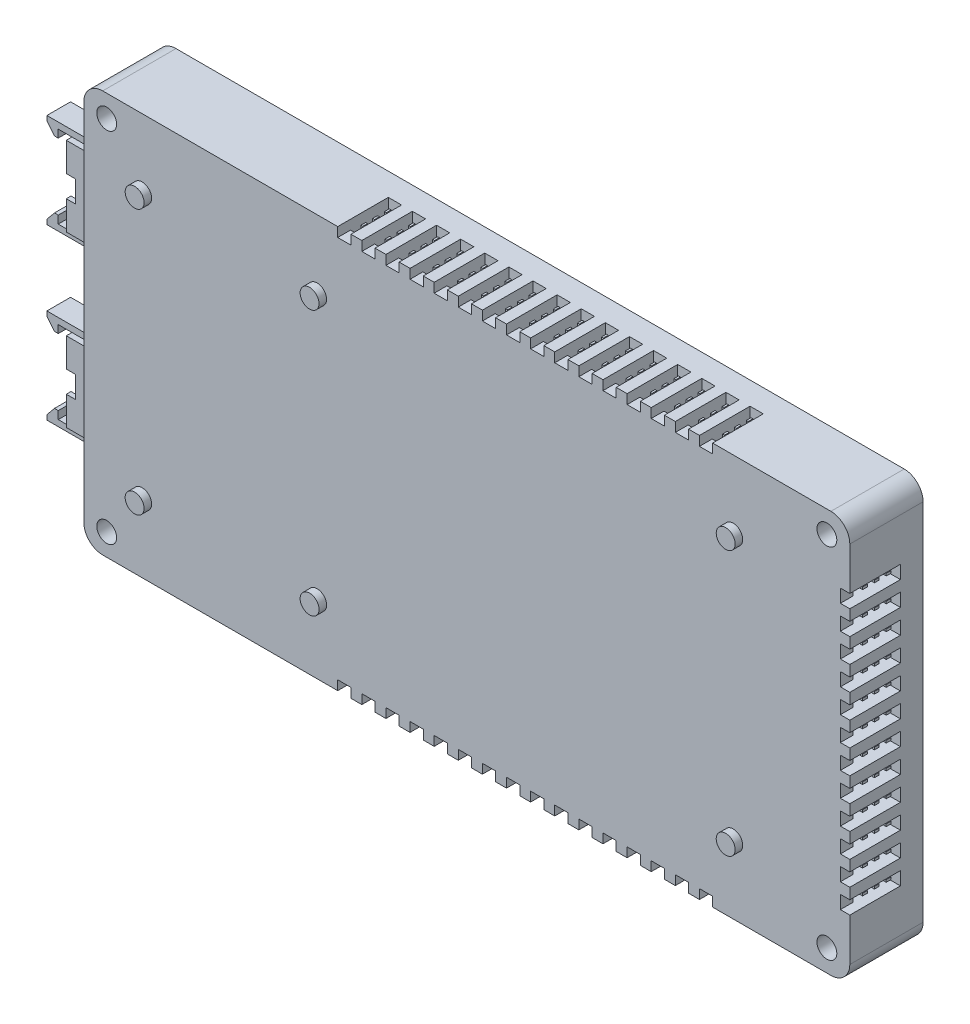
from build123d import *

# Parameters (mm, degrees)
ESQUISSE1_W                = 162
ESQUISSE1_H                = 85
BOSS_EXTRU_1_DEPTH         = 15.5
ESQUISSE3_R                = 2.1
ENL_V_MAT_EXTRU_1_DEPTH    = 93.776613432
CONG_1_R                   = 4
ESQUISSE4_W                = 15
ESQUISSE4_H                = 14.7
ENL_V_MAT_EXTRU_2_DEPTH    = 12.8
BOSS_EXTRU_2_DEPTH         = 7
ESQUISSE6_W                = 2
ESQUISSE6_H                = 4.6
ENL_V_MAT_EXTRU_3_DEPTH    = 1
ESQUISSE7_W                = 0.4
ESQUISSE7_H                = 1.5
ESQUISSE7_W_2              = 1.5
ESQUISSE7_H_2              = 0.4
BOSS_EXTRU_3_DEPTH         = 6
BOSS_EXTRU_4_DEPTH         = 2.5
ESQUISSE10_R               = 2
BOSS_EXTRU_5_DEPTH         = 1.6
ESQUISSE11_W               = 2.8
ESQUISSE11_H               = 2.7
ENL_V_MAT_EXTRU_4_DEPTH    = 2
ESQUISSE12_W               = 2.8
ESQUISSE12_H               = 8
ENL_V_MAT_EXTRU_5_DEPTH    = 7
ESQUISSE13_W               = 0.4
ESQUISSE13_H               = 1
BOSS_EXTRU_6_DEPTH         = 6
R_P_TITION_LIN_AIRE2_COUNT = 16
R_P_TITION_LIN_AIRE2_PITCH = 5.1
SYM_TRIE2_COPY_1_SKETCH_W  = 2.8
SYM_TRIE2_COPY_1_SKETCH_H  = 2.7
SYM_TRIE2_COPY_1_DEPTH     = 2
SYM_TRIE2_COPY_2_SKETCH_W  = 2.8
SYM_TRIE2_COPY_2_SKETCH_H  = 2.7
SYM_TRIE2_COPY_2_DEPTH     = 2
SYM_TRIE2_COPY_3_SKETCH_W  = 2.8
SYM_TRIE2_COPY_3_SKETCH_H  = 2.7
SYM_TRIE2_COPY_3_DEPTH     = 2
SYM_TRIE2_COPY_4_SKETCH_W  = 2.8
SYM_TRIE2_COPY_4_SKETCH_H  = 2.7
SYM_TRIE2_COPY_4_DEPTH     = 2
SYM_TRIE2_COPY_5_SKETCH_W  = 2.8
SYM_TRIE2_COPY_5_SKETCH_H  = 2.7
SYM_TRIE2_COPY_5_DEPTH     = 2
SYM_TRIE2_COPY_6_SKETCH_W  = 2.8
SYM_TRIE2_COPY_6_SKETCH_H  = 2.7
SYM_TRIE2_COPY_6_DEPTH     = 2
SYM_TRIE2_COPY_7_SKETCH_W  = 2.8
SYM_TRIE2_COPY_7_SKETCH_H  = 2.7
SYM_TRIE2_COPY_7_DEPTH     = 2
SYM_TRIE2_COPY_8_SKETCH_W  = 2.8
SYM_TRIE2_COPY_8_SKETCH_H  = 2.7
SYM_TRIE2_COPY_8_DEPTH     = 2
SYM_TRIE2_COPY_9_SKETCH_W  = 2.8
SYM_TRIE2_COPY_9_SKETCH_H  = 2.7
SYM_TRIE2_COPY_9_DEPTH     = 2
SYM_TRIE2_COPY_10_SKETCH_W = 2.8
SYM_TRIE2_COPY_10_SKETCH_H = 2.7
SYM_TRIE2_COPY_10_DEPTH    = 2
SYM_TRIE2_COPY_11_SKETCH_W = 2.8
SYM_TRIE2_COPY_11_SKETCH_H = 2.7
SYM_TRIE2_COPY_11_DEPTH    = 2
SYM_TRIE2_COPY_12_SKETCH_W = 2.8
SYM_TRIE2_COPY_12_SKETCH_H = 2.7
SYM_TRIE2_COPY_12_DEPTH    = 2
SYM_TRIE2_COPY_13_SKETCH_W = 2.8
SYM_TRIE2_COPY_13_SKETCH_H = 2.7
SYM_TRIE2_COPY_13_DEPTH    = 2
SYM_TRIE2_COPY_14_SKETCH_W = 2.8
SYM_TRIE2_COPY_14_SKETCH_H = 2.7
SYM_TRIE2_COPY_14_DEPTH    = 2
SYM_TRIE2_COPY_15_SKETCH_W = 2.8
SYM_TRIE2_COPY_15_SKETCH_H = 2.7
SYM_TRIE2_COPY_15_DEPTH    = 2
SYM_TRIE2_COPY_16_SKETCH_W = 2.8
SYM_TRIE2_COPY_16_SKETCH_H = 8
SYM_TRIE2_COPY_16_DEPTH    = 7
SYM_TRIE2_COPY_17_SKETCH_W = 2.8
SYM_TRIE2_COPY_17_SKETCH_H = 8
SYM_TRIE2_COPY_17_DEPTH    = 7
SYM_TRIE2_COPY_18_SKETCH_W = 2.8
SYM_TRIE2_COPY_18_SKETCH_H = 8
SYM_TRIE2_COPY_18_DEPTH    = 7
SYM_TRIE2_COPY_19_SKETCH_W = 2.8
SYM_TRIE2_COPY_19_SKETCH_H = 8
SYM_TRIE2_COPY_19_DEPTH    = 7
SYM_TRIE2_COPY_20_SKETCH_W = 2.8
SYM_TRIE2_COPY_20_SKETCH_H = 8
SYM_TRIE2_COPY_20_DEPTH    = 7
SYM_TRIE2_COPY_21_SKETCH_W = 2.8
SYM_TRIE2_COPY_21_SKETCH_H = 8
SYM_TRIE2_COPY_21_DEPTH    = 7
SYM_TRIE2_COPY_22_SKETCH_W = 2.8
SYM_TRIE2_COPY_22_SKETCH_H = 8
SYM_TRIE2_COPY_22_DEPTH    = 7
SYM_TRIE2_COPY_23_SKETCH_W = 2.8
SYM_TRIE2_COPY_23_SKETCH_H = 8
SYM_TRIE2_COPY_23_DEPTH    = 7
SYM_TRIE2_COPY_24_SKETCH_W = 2.8
SYM_TRIE2_COPY_24_SKETCH_H = 8
SYM_TRIE2_COPY_24_DEPTH    = 7
SYM_TRIE2_COPY_25_SKETCH_W = 2.8
SYM_TRIE2_COPY_25_SKETCH_H = 8
SYM_TRIE2_COPY_25_DEPTH    = 7
SYM_TRIE2_COPY_26_SKETCH_W = 2.8
SYM_TRIE2_COPY_26_SKETCH_H = 8
SYM_TRIE2_COPY_26_DEPTH    = 7
SYM_TRIE2_COPY_27_SKETCH_W = 2.8
SYM_TRIE2_COPY_27_SKETCH_H = 8
SYM_TRIE2_COPY_27_DEPTH    = 7
SYM_TRIE2_COPY_28_SKETCH_W = 2.8
SYM_TRIE2_COPY_28_SKETCH_H = 8
SYM_TRIE2_COPY_28_DEPTH    = 7
SYM_TRIE2_COPY_29_SKETCH_W = 2.8
SYM_TRIE2_COPY_29_SKETCH_H = 8
SYM_TRIE2_COPY_29_DEPTH    = 7
SYM_TRIE2_COPY_30_SKETCH_W = 2.8
SYM_TRIE2_COPY_30_SKETCH_H = 8
SYM_TRIE2_COPY_30_DEPTH    = 7
SYM_TRIE2_COPY_31_SKETCH_W = 0.4
SYM_TRIE2_COPY_31_SKETCH_H = 1
SYM_TRIE2_COPY_31_DEPTH    = 6
SYM_TRIE2_COPY_32_SKETCH_W = 0.4
SYM_TRIE2_COPY_32_SKETCH_H = 1
SYM_TRIE2_COPY_32_DEPTH    = 6
SYM_TRIE2_COPY_33_SKETCH_W = 0.4
SYM_TRIE2_COPY_33_SKETCH_H = 1
SYM_TRIE2_COPY_33_DEPTH    = 6
SYM_TRIE2_COPY_34_SKETCH_W = 0.4
SYM_TRIE2_COPY_34_SKETCH_H = 1
SYM_TRIE2_COPY_34_DEPTH    = 6
SYM_TRIE2_COPY_35_SKETCH_W = 0.4
SYM_TRIE2_COPY_35_SKETCH_H = 1
SYM_TRIE2_COPY_35_DEPTH    = 6
SYM_TRIE2_COPY_36_SKETCH_W = 0.4
SYM_TRIE2_COPY_36_SKETCH_H = 1
SYM_TRIE2_COPY_36_DEPTH    = 6
SYM_TRIE2_COPY_37_SKETCH_W = 0.4
SYM_TRIE2_COPY_37_SKETCH_H = 1
SYM_TRIE2_COPY_37_DEPTH    = 6
SYM_TRIE2_COPY_38_SKETCH_W = 0.4
SYM_TRIE2_COPY_38_SKETCH_H = 1
SYM_TRIE2_COPY_38_DEPTH    = 6
SYM_TRIE2_COPY_39_SKETCH_W = 0.4
SYM_TRIE2_COPY_39_SKETCH_H = 1
SYM_TRIE2_COPY_39_DEPTH    = 6
SYM_TRIE2_COPY_40_SKETCH_W = 0.4
SYM_TRIE2_COPY_40_SKETCH_H = 1
SYM_TRIE2_COPY_40_DEPTH    = 6
SYM_TRIE2_COPY_41_SKETCH_W = 0.4
SYM_TRIE2_COPY_41_SKETCH_H = 1
SYM_TRIE2_COPY_41_DEPTH    = 6
SYM_TRIE2_COPY_42_SKETCH_W = 0.4
SYM_TRIE2_COPY_42_SKETCH_H = 1
SYM_TRIE2_COPY_42_DEPTH    = 6
SYM_TRIE2_COPY_43_SKETCH_W = 0.4
SYM_TRIE2_COPY_43_SKETCH_H = 1
SYM_TRIE2_COPY_43_DEPTH    = 6
SYM_TRIE2_COPY_44_SKETCH_W = 0.4
SYM_TRIE2_COPY_44_SKETCH_H = 1
SYM_TRIE2_COPY_44_DEPTH    = 6
SYM_TRIE2_COPY_45_SKETCH_W = 0.4
SYM_TRIE2_COPY_45_SKETCH_H = 1
SYM_TRIE2_COPY_45_DEPTH    = 6
ESQUISSE14_W               = 2.7
ESQUISSE14_H               = 2.8
ENL_V_MAT_EXTRU_6_DEPTH    = 2
ESQUISSE15_W               = 8
ESQUISSE15_H               = 2.8
ENL_V_MAT_EXTRU_7_DEPTH    = 7
ESQUISSE16_W               = 1
ESQUISSE16_H               = 0.5
BOSS_EXTRU_7_DEPTH         = 6
R_P_TITION_LIN_AIRE3_COUNT = 12
R_P_TITION_LIN_AIRE3_PITCH = 5.1


with BuildPart() as part:
    # Esquisse1 → Boss.-Extru.1 (new body)
    with BuildSketch(Plane.XY):
        Rectangle(ESQUISSE1_W, ESQUISSE1_H)
    extrude(amount=BOSS_EXTRU_1_DEPTH)

    # Esquisse3 → Enl_v. mat.-Extru.1 (cut, through all)
    with BuildSketch(Plane.XY.offset(15.5)):
        with Locations((-76.15, 37.85)):
            Circle(ESQUISSE3_R)
        with Locations((-76.15, -37.85)):
            Circle(ESQUISSE3_R)
        with Locations((76.15, 37.85)):
            Circle(ESQUISSE3_R)
        with Locations((76.15, -37.85)):
            Circle(ESQUISSE3_R)
    extrude(amount=-ENL_V_MAT_EXTRU_1_DEPTH, mode=Mode.SUBTRACT)

    # Cong_1
    cong_1_edges = [part.edges().sort_by_distance(p)[0] for p in [
        (81, -42.5, 7.75),
        (-81, -42.5, 7.75),
        (-81, 42.5, 7.75),
        (81, 42.5, 7.75),
    ]]
    fillet(cong_1_edges, radius=CONG_1_R)

    # Esquisse4 → Enl_v. mat.-Extru.2 (cut)
    with BuildSketch(Plane(origin=(0, 0, 0), x_dir=(-1, 0, 0), z_dir=(0, 0, -1))):
        with Locations((73.5, 0)):
            Rectangle(ESQUISSE4_W, ESQUISSE4_H)
    extrude(amount=-ENL_V_MAT_EXTRU_2_DEPTH, mode=Mode.SUBTRACT)

    # Esquisse5 → Boss.-Extru.2 (add)
    with BuildSketch(Plane.ZY.offset(81)):
        Polygon((5.4, 26.3), (12.2, 26.3), (12.2, 9.5), (5.4, 9.5), (5.4, 13.9), (6.4, 13.9), (6.4, 10.5), (11.2, 10.5), (11.2, 25.3), (6.4, 25.3), (6.4, 21.9), (5.4, 21.9), align=None)
    boss_extru_2 = extrude(amount=BOSS_EXTRU_2_DEPTH)

    # Esquisse6 → Enl_v. mat.-Extru.3 (cut)
    with BuildSketch(Plane.XY.offset(12.2)):
        with Locations((-87, 17.9)):
            Rectangle(ESQUISSE6_W, ESQUISSE6_H)
    enl_v_mat_extru_3 = extrude(amount=-ENL_V_MAT_EXTRU_3_DEPTH, mode=Mode.SUBTRACT)

    # Esquisse7 → Boss.-Extru.3 (add)
    with BuildSketch(Plane.ZY.offset(81)):
        with Locations((8.8, 23.15)):
            Rectangle(ESQUISSE7_W, ESQUISSE7_H)
        with Locations((8.8, 12.65)):
            Rectangle(ESQUISSE7_W, ESQUISSE7_H)
        with Locations((7.75, 19.8)):
            Rectangle(ESQUISSE7_W_2, ESQUISSE7_H_2)
        with Locations((7.75, 16)):
            Rectangle(ESQUISSE7_W_2, ESQUISSE7_H_2)
        with Locations((9.85, 19.8)):
            Rectangle(ESQUISSE7_W_2, ESQUISSE7_H_2)
        with Locations((9.85, 16)):
            Rectangle(ESQUISSE7_W_2, ESQUISSE7_H_2)
    boss_extru_3 = extrude(amount=BOSS_EXTRU_3_DEPTH)

    # Esquisse9 → Boss.-Extru.4 (add, symmetric)
    with BuildSketch(Plane.XY.offset(8.8)):
        Polygon((-81, 27.9), (-93, 27.9), (-93, 26.9), (-91.4, 24.95), (-90.6, 24.95), (-90.6, 26.6), (-81, 26.6), align=None)
        Polygon((-81, 9.2), (-81, 7.9), (-93, 7.9), (-93, 8.9), (-91.4, 10.85), (-90.6, 10.85), (-90.6, 9.2), align=None)
    boss_extru_4 = extrude(amount=BOSS_EXTRU_4_DEPTH, both=True)

    # Sym_trie1: Boss.-Extru.2, Enl_v. mat.-Extru.3, Boss.-Extru.3, Boss.-Extru.4 across plane
    add(boss_extru_2.mirror(Plane.ZX))
    add(enl_v_mat_extru_3.mirror(Plane.ZX), mode=Mode.SUBTRACT)
    add(boss_extru_3.mirror(Plane.ZX))
    add(boss_extru_4.mirror(Plane.ZX))

    # Esquisse10 → Boss.-Extru.5 (add)
    with BuildSketch(Plane.XY.offset(15.5)):
        with Locations((-68.65, 28)):
            Circle(ESQUISSE10_R)
        with Locations((-68.65, -28)):
            Circle(ESQUISSE10_R)
        with Locations((-31.65, -28)):
            Circle(ESQUISSE10_R)
        with Locations((-31.65, 28)):
            Circle(ESQUISSE10_R)
        with Locations((56.35, 28)):
            Circle(ESQUISSE10_R)
        with Locations((56.35, -28)):
            Circle(ESQUISSE10_R)
    extrude(amount=BOSS_EXTRU_5_DEPTH)

    # Esquisse11 → Enl_v. mat.-Extru.4 (cut)
    with BuildSketch(Plane(origin=(0, 42.5, 0), x_dir=(1, 0, 0), z_dir=(0, 1, 0))):
        with Locations((50.6, -14.15)):
            Rectangle(ESQUISSE11_W, ESQUISSE11_H)
    enl_v_mat_extru_4 = extrude(amount=-ENL_V_MAT_EXTRU_4_DEPTH, mode=Mode.SUBTRACT)

    # Esquisse12 → Enl_v. mat.-Extru.5 (cut)
    with BuildSketch(Plane(origin=(0, 42.5, 0), x_dir=(1, 0, 0), z_dir=(0, 1, 0))):
        with Locations((50.6, -8.8)):
            Rectangle(ESQUISSE12_W, ESQUISSE12_H)
    enl_v_mat_extru_5 = extrude(amount=-ENL_V_MAT_EXTRU_5_DEPTH, mode=Mode.SUBTRACT)

    # Esquisse13 → Boss.-Extru.6 (add)
    with BuildSketch(Plane(origin=(0, 35.5, 0), x_dir=(1, 0, 0), z_dir=(0, 1, 0))):
        with Locations((50.6, -6.3)):
            Rectangle(ESQUISSE13_W, ESQUISSE13_H)
        with Locations((50.6, -8.8)):
            Rectangle(ESQUISSE13_W, ESQUISSE13_H)
        with Locations((50.6, -11.3)):
            Rectangle(ESQUISSE13_W, ESQUISSE13_H)
    boss_extru_6 = extrude(amount=BOSS_EXTRU_6_DEPTH)

    # R_p_tition lin_aire2: Enl_v. mat.-Extru.4, Enl_v. mat.-Extru.5, Boss.-Extru.6 ×16
    with Locations(*[(-i * R_P_TITION_LIN_AIRE2_PITCH, 0, 0) for i in range(1, R_P_TITION_LIN_AIRE2_COUNT)]):
        add(enl_v_mat_extru_4, mode=Mode.SUBTRACT)
        add(enl_v_mat_extru_5, mode=Mode.SUBTRACT)
        add(boss_extru_6)

    # Sym_trie2: Enl_v. mat.-Extru.4, Enl_v. mat.-Extru.5, Boss.-Extru.6 across plane
    add(enl_v_mat_extru_4.mirror(Plane.ZX), mode=Mode.SUBTRACT)
    add(enl_v_mat_extru_5.mirror(Plane.ZX), mode=Mode.SUBTRACT)
    add(boss_extru_6.mirror(Plane.ZX))

    # Sym_trie2 copy 1 sketch → Sym_trie2 copy 1 (cut)
    with BuildSketch(Plane(origin=(-5.1, -42.5, 0), x_dir=(1, 0, 0), z_dir=(0, -1, 0))):
        with Locations((50.6, 14.15)):
            Rectangle(SYM_TRIE2_COPY_1_SKETCH_W, SYM_TRIE2_COPY_1_SKETCH_H)
    extrude(amount=-SYM_TRIE2_COPY_1_DEPTH, mode=Mode.SUBTRACT)

    # Sym_trie2 copy 2 sketch → Sym_trie2 copy 2 (cut)
    with BuildSketch(Plane(origin=(-10.2, -42.5, 0), x_dir=(1, 0, 0), z_dir=(0, -1, 0))):
        with Locations((50.6, 14.15)):
            Rectangle(SYM_TRIE2_COPY_2_SKETCH_W, SYM_TRIE2_COPY_2_SKETCH_H)
    extrude(amount=-SYM_TRIE2_COPY_2_DEPTH, mode=Mode.SUBTRACT)

    # Sym_trie2 copy 3 sketch → Sym_trie2 copy 3 (cut)
    with BuildSketch(Plane(origin=(-15.3, -42.5, 0), x_dir=(1, 0, 0), z_dir=(0, -1, 0))):
        with Locations((50.6, 14.15)):
            Rectangle(SYM_TRIE2_COPY_3_SKETCH_W, SYM_TRIE2_COPY_3_SKETCH_H)
    extrude(amount=-SYM_TRIE2_COPY_3_DEPTH, mode=Mode.SUBTRACT)

    # Sym_trie2 copy 4 sketch → Sym_trie2 copy 4 (cut)
    with BuildSketch(Plane(origin=(-20.4, -42.5, 0), x_dir=(1, 0, 0), z_dir=(0, -1, 0))):
        with Locations((50.6, 14.15)):
            Rectangle(SYM_TRIE2_COPY_4_SKETCH_W, SYM_TRIE2_COPY_4_SKETCH_H)
    extrude(amount=-SYM_TRIE2_COPY_4_DEPTH, mode=Mode.SUBTRACT)

    # Sym_trie2 copy 5 sketch → Sym_trie2 copy 5 (cut)
    with BuildSketch(Plane(origin=(-25.5, -42.5, 0), x_dir=(1, 0, 0), z_dir=(0, -1, 0))):
        with Locations((50.6, 14.15)):
            Rectangle(SYM_TRIE2_COPY_5_SKETCH_W, SYM_TRIE2_COPY_5_SKETCH_H)
    extrude(amount=-SYM_TRIE2_COPY_5_DEPTH, mode=Mode.SUBTRACT)

    # Sym_trie2 copy 6 sketch → Sym_trie2 copy 6 (cut)
    with BuildSketch(Plane(origin=(-30.6, -42.5, 0), x_dir=(1, 0, 0), z_dir=(0, -1, 0))):
        with Locations((50.6, 14.15)):
            Rectangle(SYM_TRIE2_COPY_6_SKETCH_W, SYM_TRIE2_COPY_6_SKETCH_H)
    extrude(amount=-SYM_TRIE2_COPY_6_DEPTH, mode=Mode.SUBTRACT)

    # Sym_trie2 copy 7 sketch → Sym_trie2 copy 7 (cut)
    with BuildSketch(Plane(origin=(-35.7, -42.5, 0), x_dir=(1, 0, 0), z_dir=(0, -1, 0))):
        with Locations((50.6, 14.15)):
            Rectangle(SYM_TRIE2_COPY_7_SKETCH_W, SYM_TRIE2_COPY_7_SKETCH_H)
    extrude(amount=-SYM_TRIE2_COPY_7_DEPTH, mode=Mode.SUBTRACT)

    # Sym_trie2 copy 8 sketch → Sym_trie2 copy 8 (cut)
    with BuildSketch(Plane(origin=(-40.8, -42.5, 0), x_dir=(1, 0, 0), z_dir=(0, -1, 0))):
        with Locations((50.6, 14.15)):
            Rectangle(SYM_TRIE2_COPY_8_SKETCH_W, SYM_TRIE2_COPY_8_SKETCH_H)
    extrude(amount=-SYM_TRIE2_COPY_8_DEPTH, mode=Mode.SUBTRACT)

    # Sym_trie2 copy 9 sketch → Sym_trie2 copy 9 (cut)
    with BuildSketch(Plane(origin=(-45.9, -42.5, 0), x_dir=(1, 0, 0), z_dir=(0, -1, 0))):
        with Locations((50.6, 14.15)):
            Rectangle(SYM_TRIE2_COPY_9_SKETCH_W, SYM_TRIE2_COPY_9_SKETCH_H)
    extrude(amount=-SYM_TRIE2_COPY_9_DEPTH, mode=Mode.SUBTRACT)

    # Sym_trie2 copy 10 sketch → Sym_trie2 copy 10 (cut)
    with BuildSketch(Plane(origin=(-51, -42.5, 0), x_dir=(1, 0, 0), z_dir=(0, -1, 0))):
        with Locations((50.6, 14.15)):
            Rectangle(SYM_TRIE2_COPY_10_SKETCH_W, SYM_TRIE2_COPY_10_SKETCH_H)
    extrude(amount=-SYM_TRIE2_COPY_10_DEPTH, mode=Mode.SUBTRACT)

    # Sym_trie2 copy 11 sketch → Sym_trie2 copy 11 (cut)
    with BuildSketch(Plane(origin=(-56.1, -42.5, 0), x_dir=(1, 0, 0), z_dir=(0, -1, 0))):
        with Locations((50.6, 14.15)):
            Rectangle(SYM_TRIE2_COPY_11_SKETCH_W, SYM_TRIE2_COPY_11_SKETCH_H)
    extrude(amount=-SYM_TRIE2_COPY_11_DEPTH, mode=Mode.SUBTRACT)

    # Sym_trie2 copy 12 sketch → Sym_trie2 copy 12 (cut)
    with BuildSketch(Plane(origin=(-61.2, -42.5, 0), x_dir=(1, 0, 0), z_dir=(0, -1, 0))):
        with Locations((50.6, 14.15)):
            Rectangle(SYM_TRIE2_COPY_12_SKETCH_W, SYM_TRIE2_COPY_12_SKETCH_H)
    extrude(amount=-SYM_TRIE2_COPY_12_DEPTH, mode=Mode.SUBTRACT)

    # Sym_trie2 copy 13 sketch → Sym_trie2 copy 13 (cut)
    with BuildSketch(Plane(origin=(-66.3, -42.5, 0), x_dir=(1, 0, 0), z_dir=(0, -1, 0))):
        with Locations((50.6, 14.15)):
            Rectangle(SYM_TRIE2_COPY_13_SKETCH_W, SYM_TRIE2_COPY_13_SKETCH_H)
    extrude(amount=-SYM_TRIE2_COPY_13_DEPTH, mode=Mode.SUBTRACT)

    # Sym_trie2 copy 14 sketch → Sym_trie2 copy 14 (cut)
    with BuildSketch(Plane(origin=(-71.4, -42.5, 0), x_dir=(1, 0, 0), z_dir=(0, -1, 0))):
        with Locations((50.6, 14.15)):
            Rectangle(SYM_TRIE2_COPY_14_SKETCH_W, SYM_TRIE2_COPY_14_SKETCH_H)
    extrude(amount=-SYM_TRIE2_COPY_14_DEPTH, mode=Mode.SUBTRACT)

    # Sym_trie2 copy 15 sketch → Sym_trie2 copy 15 (cut)
    with BuildSketch(Plane(origin=(-76.5, -42.5, 0), x_dir=(1, 0, 0), z_dir=(0, -1, 0))):
        with Locations((50.6, 14.15)):
            Rectangle(SYM_TRIE2_COPY_15_SKETCH_W, SYM_TRIE2_COPY_15_SKETCH_H)
    extrude(amount=-SYM_TRIE2_COPY_15_DEPTH, mode=Mode.SUBTRACT)

    # Sym_trie2 copy 16 sketch → Sym_trie2 copy 16 (cut)
    with BuildSketch(Plane(origin=(-5.1, -42.5, 0), x_dir=(1, 0, 0), z_dir=(0, -1, 0))):
        with Locations((50.6, 8.8)):
            Rectangle(SYM_TRIE2_COPY_16_SKETCH_W, SYM_TRIE2_COPY_16_SKETCH_H)
    extrude(amount=-SYM_TRIE2_COPY_16_DEPTH, mode=Mode.SUBTRACT)

    # Sym_trie2 copy 17 sketch → Sym_trie2 copy 17 (cut)
    with BuildSketch(Plane(origin=(-10.2, -42.5, 0), x_dir=(1, 0, 0), z_dir=(0, -1, 0))):
        with Locations((50.6, 8.8)):
            Rectangle(SYM_TRIE2_COPY_17_SKETCH_W, SYM_TRIE2_COPY_17_SKETCH_H)
    extrude(amount=-SYM_TRIE2_COPY_17_DEPTH, mode=Mode.SUBTRACT)

    # Sym_trie2 copy 18 sketch → Sym_trie2 copy 18 (cut)
    with BuildSketch(Plane(origin=(-15.3, -42.5, 0), x_dir=(1, 0, 0), z_dir=(0, -1, 0))):
        with Locations((50.6, 8.8)):
            Rectangle(SYM_TRIE2_COPY_18_SKETCH_W, SYM_TRIE2_COPY_18_SKETCH_H)
    extrude(amount=-SYM_TRIE2_COPY_18_DEPTH, mode=Mode.SUBTRACT)

    # Sym_trie2 copy 19 sketch → Sym_trie2 copy 19 (cut)
    with BuildSketch(Plane(origin=(-20.4, -42.5, 0), x_dir=(1, 0, 0), z_dir=(0, -1, 0))):
        with Locations((50.6, 8.8)):
            Rectangle(SYM_TRIE2_COPY_19_SKETCH_W, SYM_TRIE2_COPY_19_SKETCH_H)
    extrude(amount=-SYM_TRIE2_COPY_19_DEPTH, mode=Mode.SUBTRACT)

    # Sym_trie2 copy 20 sketch → Sym_trie2 copy 20 (cut)
    with BuildSketch(Plane(origin=(-25.5, -42.5, 0), x_dir=(1, 0, 0), z_dir=(0, -1, 0))):
        with Locations((50.6, 8.8)):
            Rectangle(SYM_TRIE2_COPY_20_SKETCH_W, SYM_TRIE2_COPY_20_SKETCH_H)
    extrude(amount=-SYM_TRIE2_COPY_20_DEPTH, mode=Mode.SUBTRACT)

    # Sym_trie2 copy 21 sketch → Sym_trie2 copy 21 (cut)
    with BuildSketch(Plane(origin=(-30.6, -42.5, 0), x_dir=(1, 0, 0), z_dir=(0, -1, 0))):
        with Locations((50.6, 8.8)):
            Rectangle(SYM_TRIE2_COPY_21_SKETCH_W, SYM_TRIE2_COPY_21_SKETCH_H)
    extrude(amount=-SYM_TRIE2_COPY_21_DEPTH, mode=Mode.SUBTRACT)

    # Sym_trie2 copy 22 sketch → Sym_trie2 copy 22 (cut)
    with BuildSketch(Plane(origin=(-35.7, -42.5, 0), x_dir=(1, 0, 0), z_dir=(0, -1, 0))):
        with Locations((50.6, 8.8)):
            Rectangle(SYM_TRIE2_COPY_22_SKETCH_W, SYM_TRIE2_COPY_22_SKETCH_H)
    extrude(amount=-SYM_TRIE2_COPY_22_DEPTH, mode=Mode.SUBTRACT)

    # Sym_trie2 copy 23 sketch → Sym_trie2 copy 23 (cut)
    with BuildSketch(Plane(origin=(-40.8, -42.5, 0), x_dir=(1, 0, 0), z_dir=(0, -1, 0))):
        with Locations((50.6, 8.8)):
            Rectangle(SYM_TRIE2_COPY_23_SKETCH_W, SYM_TRIE2_COPY_23_SKETCH_H)
    extrude(amount=-SYM_TRIE2_COPY_23_DEPTH, mode=Mode.SUBTRACT)

    # Sym_trie2 copy 24 sketch → Sym_trie2 copy 24 (cut)
    with BuildSketch(Plane(origin=(-45.9, -42.5, 0), x_dir=(1, 0, 0), z_dir=(0, -1, 0))):
        with Locations((50.6, 8.8)):
            Rectangle(SYM_TRIE2_COPY_24_SKETCH_W, SYM_TRIE2_COPY_24_SKETCH_H)
    extrude(amount=-SYM_TRIE2_COPY_24_DEPTH, mode=Mode.SUBTRACT)

    # Sym_trie2 copy 25 sketch → Sym_trie2 copy 25 (cut)
    with BuildSketch(Plane(origin=(-51, -42.5, 0), x_dir=(1, 0, 0), z_dir=(0, -1, 0))):
        with Locations((50.6, 8.8)):
            Rectangle(SYM_TRIE2_COPY_25_SKETCH_W, SYM_TRIE2_COPY_25_SKETCH_H)
    extrude(amount=-SYM_TRIE2_COPY_25_DEPTH, mode=Mode.SUBTRACT)

    # Sym_trie2 copy 26 sketch → Sym_trie2 copy 26 (cut)
    with BuildSketch(Plane(origin=(-56.1, -42.5, 0), x_dir=(1, 0, 0), z_dir=(0, -1, 0))):
        with Locations((50.6, 8.8)):
            Rectangle(SYM_TRIE2_COPY_26_SKETCH_W, SYM_TRIE2_COPY_26_SKETCH_H)
    extrude(amount=-SYM_TRIE2_COPY_26_DEPTH, mode=Mode.SUBTRACT)

    # Sym_trie2 copy 27 sketch → Sym_trie2 copy 27 (cut)
    with BuildSketch(Plane(origin=(-61.2, -42.5, 0), x_dir=(1, 0, 0), z_dir=(0, -1, 0))):
        with Locations((50.6, 8.8)):
            Rectangle(SYM_TRIE2_COPY_27_SKETCH_W, SYM_TRIE2_COPY_27_SKETCH_H)
    extrude(amount=-SYM_TRIE2_COPY_27_DEPTH, mode=Mode.SUBTRACT)

    # Sym_trie2 copy 28 sketch → Sym_trie2 copy 28 (cut)
    with BuildSketch(Plane(origin=(-66.3, -42.5, 0), x_dir=(1, 0, 0), z_dir=(0, -1, 0))):
        with Locations((50.6, 8.8)):
            Rectangle(SYM_TRIE2_COPY_28_SKETCH_W, SYM_TRIE2_COPY_28_SKETCH_H)
    extrude(amount=-SYM_TRIE2_COPY_28_DEPTH, mode=Mode.SUBTRACT)

    # Sym_trie2 copy 29 sketch → Sym_trie2 copy 29 (cut)
    with BuildSketch(Plane(origin=(-71.4, -42.5, 0), x_dir=(1, 0, 0), z_dir=(0, -1, 0))):
        with Locations((50.6, 8.8)):
            Rectangle(SYM_TRIE2_COPY_29_SKETCH_W, SYM_TRIE2_COPY_29_SKETCH_H)
    extrude(amount=-SYM_TRIE2_COPY_29_DEPTH, mode=Mode.SUBTRACT)

    # Sym_trie2 copy 30 sketch → Sym_trie2 copy 30 (cut)
    with BuildSketch(Plane(origin=(-76.5, -42.5, 0), x_dir=(1, 0, 0), z_dir=(0, -1, 0))):
        with Locations((50.6, 8.8)):
            Rectangle(SYM_TRIE2_COPY_30_SKETCH_W, SYM_TRIE2_COPY_30_SKETCH_H)
    extrude(amount=-SYM_TRIE2_COPY_30_DEPTH, mode=Mode.SUBTRACT)

    # Sym_trie2 copy 31 sketch → Sym_trie2 copy 31 (add)
    with BuildSketch(Plane(origin=(-5.1, -35.5, 0), x_dir=(1, 0, 0), z_dir=(0, -1, 0))):
        with Locations((50.6, 6.3)):
            Rectangle(SYM_TRIE2_COPY_31_SKETCH_W, SYM_TRIE2_COPY_31_SKETCH_H)
        with Locations((50.6, 8.8)):
            Rectangle(SYM_TRIE2_COPY_31_SKETCH_W, SYM_TRIE2_COPY_31_SKETCH_H)
        with Locations((50.6, 11.3)):
            Rectangle(SYM_TRIE2_COPY_31_SKETCH_W, SYM_TRIE2_COPY_31_SKETCH_H)
    extrude(amount=SYM_TRIE2_COPY_31_DEPTH)

    # Sym_trie2 copy 32 sketch → Sym_trie2 copy 32 (add)
    with BuildSketch(Plane(origin=(-10.2, -35.5, 0), x_dir=(1, 0, 0), z_dir=(0, -1, 0))):
        with Locations((50.6, 6.3)):
            Rectangle(SYM_TRIE2_COPY_32_SKETCH_W, SYM_TRIE2_COPY_32_SKETCH_H)
        with Locations((50.6, 8.8)):
            Rectangle(SYM_TRIE2_COPY_32_SKETCH_W, SYM_TRIE2_COPY_32_SKETCH_H)
        with Locations((50.6, 11.3)):
            Rectangle(SYM_TRIE2_COPY_32_SKETCH_W, SYM_TRIE2_COPY_32_SKETCH_H)
    extrude(amount=SYM_TRIE2_COPY_32_DEPTH)

    # Sym_trie2 copy 33 sketch → Sym_trie2 copy 33 (add)
    with BuildSketch(Plane(origin=(-15.3, -35.5, 0), x_dir=(1, 0, 0), z_dir=(0, -1, 0))):
        with Locations((50.6, 6.3)):
            Rectangle(SYM_TRIE2_COPY_33_SKETCH_W, SYM_TRIE2_COPY_33_SKETCH_H)
        with Locations((50.6, 8.8)):
            Rectangle(SYM_TRIE2_COPY_33_SKETCH_W, SYM_TRIE2_COPY_33_SKETCH_H)
        with Locations((50.6, 11.3)):
            Rectangle(SYM_TRIE2_COPY_33_SKETCH_W, SYM_TRIE2_COPY_33_SKETCH_H)
    extrude(amount=SYM_TRIE2_COPY_33_DEPTH)

    # Sym_trie2 copy 34 sketch → Sym_trie2 copy 34 (add)
    with BuildSketch(Plane(origin=(-20.4, -35.5, 0), x_dir=(1, 0, 0), z_dir=(0, -1, 0))):
        with Locations((50.6, 6.3)):
            Rectangle(SYM_TRIE2_COPY_34_SKETCH_W, SYM_TRIE2_COPY_34_SKETCH_H)
        with Locations((50.6, 8.8)):
            Rectangle(SYM_TRIE2_COPY_34_SKETCH_W, SYM_TRIE2_COPY_34_SKETCH_H)
        with Locations((50.6, 11.3)):
            Rectangle(SYM_TRIE2_COPY_34_SKETCH_W, SYM_TRIE2_COPY_34_SKETCH_H)
    extrude(amount=SYM_TRIE2_COPY_34_DEPTH)

    # Sym_trie2 copy 35 sketch → Sym_trie2 copy 35 (add)
    with BuildSketch(Plane(origin=(-25.5, -35.5, 0), x_dir=(1, 0, 0), z_dir=(0, -1, 0))):
        with Locations((50.6, 6.3)):
            Rectangle(SYM_TRIE2_COPY_35_SKETCH_W, SYM_TRIE2_COPY_35_SKETCH_H)
        with Locations((50.6, 8.8)):
            Rectangle(SYM_TRIE2_COPY_35_SKETCH_W, SYM_TRIE2_COPY_35_SKETCH_H)
        with Locations((50.6, 11.3)):
            Rectangle(SYM_TRIE2_COPY_35_SKETCH_W, SYM_TRIE2_COPY_35_SKETCH_H)
    extrude(amount=SYM_TRIE2_COPY_35_DEPTH)

    # Sym_trie2 copy 36 sketch → Sym_trie2 copy 36 (add)
    with BuildSketch(Plane(origin=(-30.6, -35.5, 0), x_dir=(1, 0, 0), z_dir=(0, -1, 0))):
        with Locations((50.6, 6.3)):
            Rectangle(SYM_TRIE2_COPY_36_SKETCH_W, SYM_TRIE2_COPY_36_SKETCH_H)
        with Locations((50.6, 8.8)):
            Rectangle(SYM_TRIE2_COPY_36_SKETCH_W, SYM_TRIE2_COPY_36_SKETCH_H)
        with Locations((50.6, 11.3)):
            Rectangle(SYM_TRIE2_COPY_36_SKETCH_W, SYM_TRIE2_COPY_36_SKETCH_H)
    extrude(amount=SYM_TRIE2_COPY_36_DEPTH)

    # Sym_trie2 copy 37 sketch → Sym_trie2 copy 37 (add)
    with BuildSketch(Plane(origin=(-35.7, -35.5, 0), x_dir=(1, 0, 0), z_dir=(0, -1, 0))):
        with Locations((50.6, 6.3)):
            Rectangle(SYM_TRIE2_COPY_37_SKETCH_W, SYM_TRIE2_COPY_37_SKETCH_H)
        with Locations((50.6, 8.8)):
            Rectangle(SYM_TRIE2_COPY_37_SKETCH_W, SYM_TRIE2_COPY_37_SKETCH_H)
        with Locations((50.6, 11.3)):
            Rectangle(SYM_TRIE2_COPY_37_SKETCH_W, SYM_TRIE2_COPY_37_SKETCH_H)
    extrude(amount=SYM_TRIE2_COPY_37_DEPTH)

    # Sym_trie2 copy 38 sketch → Sym_trie2 copy 38 (add)
    with BuildSketch(Plane(origin=(-40.8, -35.5, 0), x_dir=(1, 0, 0), z_dir=(0, -1, 0))):
        with Locations((50.6, 6.3)):
            Rectangle(SYM_TRIE2_COPY_38_SKETCH_W, SYM_TRIE2_COPY_38_SKETCH_H)
        with Locations((50.6, 8.8)):
            Rectangle(SYM_TRIE2_COPY_38_SKETCH_W, SYM_TRIE2_COPY_38_SKETCH_H)
        with Locations((50.6, 11.3)):
            Rectangle(SYM_TRIE2_COPY_38_SKETCH_W, SYM_TRIE2_COPY_38_SKETCH_H)
    extrude(amount=SYM_TRIE2_COPY_38_DEPTH)

    # Sym_trie2 copy 39 sketch → Sym_trie2 copy 39 (add)
    with BuildSketch(Plane(origin=(-45.9, -35.5, 0), x_dir=(1, 0, 0), z_dir=(0, -1, 0))):
        with Locations((50.6, 6.3)):
            Rectangle(SYM_TRIE2_COPY_39_SKETCH_W, SYM_TRIE2_COPY_39_SKETCH_H)
        with Locations((50.6, 8.8)):
            Rectangle(SYM_TRIE2_COPY_39_SKETCH_W, SYM_TRIE2_COPY_39_SKETCH_H)
        with Locations((50.6, 11.3)):
            Rectangle(SYM_TRIE2_COPY_39_SKETCH_W, SYM_TRIE2_COPY_39_SKETCH_H)
    extrude(amount=SYM_TRIE2_COPY_39_DEPTH)

    # Sym_trie2 copy 40 sketch → Sym_trie2 copy 40 (add)
    with BuildSketch(Plane(origin=(-51, -35.5, 0), x_dir=(1, 0, 0), z_dir=(0, -1, 0))):
        with Locations((50.6, 6.3)):
            Rectangle(SYM_TRIE2_COPY_40_SKETCH_W, SYM_TRIE2_COPY_40_SKETCH_H)
        with Locations((50.6, 8.8)):
            Rectangle(SYM_TRIE2_COPY_40_SKETCH_W, SYM_TRIE2_COPY_40_SKETCH_H)
        with Locations((50.6, 11.3)):
            Rectangle(SYM_TRIE2_COPY_40_SKETCH_W, SYM_TRIE2_COPY_40_SKETCH_H)
    extrude(amount=SYM_TRIE2_COPY_40_DEPTH)

    # Sym_trie2 copy 41 sketch → Sym_trie2 copy 41 (add)
    with BuildSketch(Plane(origin=(-56.1, -35.5, 0), x_dir=(1, 0, 0), z_dir=(0, -1, 0))):
        with Locations((50.6, 6.3)):
            Rectangle(SYM_TRIE2_COPY_41_SKETCH_W, SYM_TRIE2_COPY_41_SKETCH_H)
        with Locations((50.6, 8.8)):
            Rectangle(SYM_TRIE2_COPY_41_SKETCH_W, SYM_TRIE2_COPY_41_SKETCH_H)
        with Locations((50.6, 11.3)):
            Rectangle(SYM_TRIE2_COPY_41_SKETCH_W, SYM_TRIE2_COPY_41_SKETCH_H)
    extrude(amount=SYM_TRIE2_COPY_41_DEPTH)

    # Sym_trie2 copy 42 sketch → Sym_trie2 copy 42 (add)
    with BuildSketch(Plane(origin=(-61.2, -35.5, 0), x_dir=(1, 0, 0), z_dir=(0, -1, 0))):
        with Locations((50.6, 6.3)):
            Rectangle(SYM_TRIE2_COPY_42_SKETCH_W, SYM_TRIE2_COPY_42_SKETCH_H)
        with Locations((50.6, 8.8)):
            Rectangle(SYM_TRIE2_COPY_42_SKETCH_W, SYM_TRIE2_COPY_42_SKETCH_H)
        with Locations((50.6, 11.3)):
            Rectangle(SYM_TRIE2_COPY_42_SKETCH_W, SYM_TRIE2_COPY_42_SKETCH_H)
    extrude(amount=SYM_TRIE2_COPY_42_DEPTH)

    # Sym_trie2 copy 43 sketch → Sym_trie2 copy 43 (add)
    with BuildSketch(Plane(origin=(-66.3, -35.5, 0), x_dir=(1, 0, 0), z_dir=(0, -1, 0))):
        with Locations((50.6, 6.3)):
            Rectangle(SYM_TRIE2_COPY_43_SKETCH_W, SYM_TRIE2_COPY_43_SKETCH_H)
        with Locations((50.6, 8.8)):
            Rectangle(SYM_TRIE2_COPY_43_SKETCH_W, SYM_TRIE2_COPY_43_SKETCH_H)
        with Locations((50.6, 11.3)):
            Rectangle(SYM_TRIE2_COPY_43_SKETCH_W, SYM_TRIE2_COPY_43_SKETCH_H)
    extrude(amount=SYM_TRIE2_COPY_43_DEPTH)

    # Sym_trie2 copy 44 sketch → Sym_trie2 copy 44 (add)
    with BuildSketch(Plane(origin=(-71.4, -35.5, 0), x_dir=(1, 0, 0), z_dir=(0, -1, 0))):
        with Locations((50.6, 6.3)):
            Rectangle(SYM_TRIE2_COPY_44_SKETCH_W, SYM_TRIE2_COPY_44_SKETCH_H)
        with Locations((50.6, 8.8)):
            Rectangle(SYM_TRIE2_COPY_44_SKETCH_W, SYM_TRIE2_COPY_44_SKETCH_H)
        with Locations((50.6, 11.3)):
            Rectangle(SYM_TRIE2_COPY_44_SKETCH_W, SYM_TRIE2_COPY_44_SKETCH_H)
    extrude(amount=SYM_TRIE2_COPY_44_DEPTH)

    # Sym_trie2 copy 45 sketch → Sym_trie2 copy 45 (add)
    with BuildSketch(Plane(origin=(-76.5, -35.5, 0), x_dir=(1, 0, 0), z_dir=(0, -1, 0))):
        with Locations((50.6, 6.3)):
            Rectangle(SYM_TRIE2_COPY_45_SKETCH_W, SYM_TRIE2_COPY_45_SKETCH_H)
        with Locations((50.6, 8.8)):
            Rectangle(SYM_TRIE2_COPY_45_SKETCH_W, SYM_TRIE2_COPY_45_SKETCH_H)
        with Locations((50.6, 11.3)):
            Rectangle(SYM_TRIE2_COPY_45_SKETCH_W, SYM_TRIE2_COPY_45_SKETCH_H)
    extrude(amount=SYM_TRIE2_COPY_45_DEPTH)

    # Esquisse14 → Enl_v. mat.-Extru.6 (cut)
    with BuildSketch(Plane(origin=(81, 0, 0), x_dir=(0, 0, -1), z_dir=(1, 0, 0))):
        with Locations((-14.15, -28.05)):
            Rectangle(ESQUISSE14_W, ESQUISSE14_H)
    enl_v_mat_extru_6 = extrude(amount=-ENL_V_MAT_EXTRU_6_DEPTH, mode=Mode.SUBTRACT)

    # Esquisse15 → Enl_v. mat.-Extru.7 (cut)
    with BuildSketch(Plane(origin=(81, 0, 0), x_dir=(0, 0, -1), z_dir=(1, 0, 0))):
        with Locations((-8.8, -28.05)):
            Rectangle(ESQUISSE15_W, ESQUISSE15_H)
    enl_v_mat_extru_7 = extrude(amount=-ENL_V_MAT_EXTRU_7_DEPTH, mode=Mode.SUBTRACT)

    # Esquisse16 → Boss.-Extru.7 (add)
    with BuildSketch(Plane(origin=(74, 0, 0), x_dir=(0, 0, -1), z_dir=(1, 0, 0))):
        with Locations((-11.3, -28.05)):
            Rectangle(ESQUISSE16_W, ESQUISSE16_H)
        with Locations((-8.8, -28.05)):
            Rectangle(ESQUISSE16_W, ESQUISSE16_H)
        with Locations((-6.3, -28.05)):
            Rectangle(ESQUISSE16_W, ESQUISSE16_H)
    boss_extru_7 = extrude(amount=BOSS_EXTRU_7_DEPTH)

    # R_p_tition lin_aire3: Enl_v. mat.-Extru.6, Enl_v. mat.-Extru.7, Boss.-Extru.7 ×12
    with Locations(*[(0, i * R_P_TITION_LIN_AIRE3_PITCH, 0) for i in range(1, R_P_TITION_LIN_AIRE3_COUNT)]):
        add(enl_v_mat_extru_6, mode=Mode.SUBTRACT)
        add(enl_v_mat_extru_7, mode=Mode.SUBTRACT)
        add(boss_extru_7)


solid = part.part
